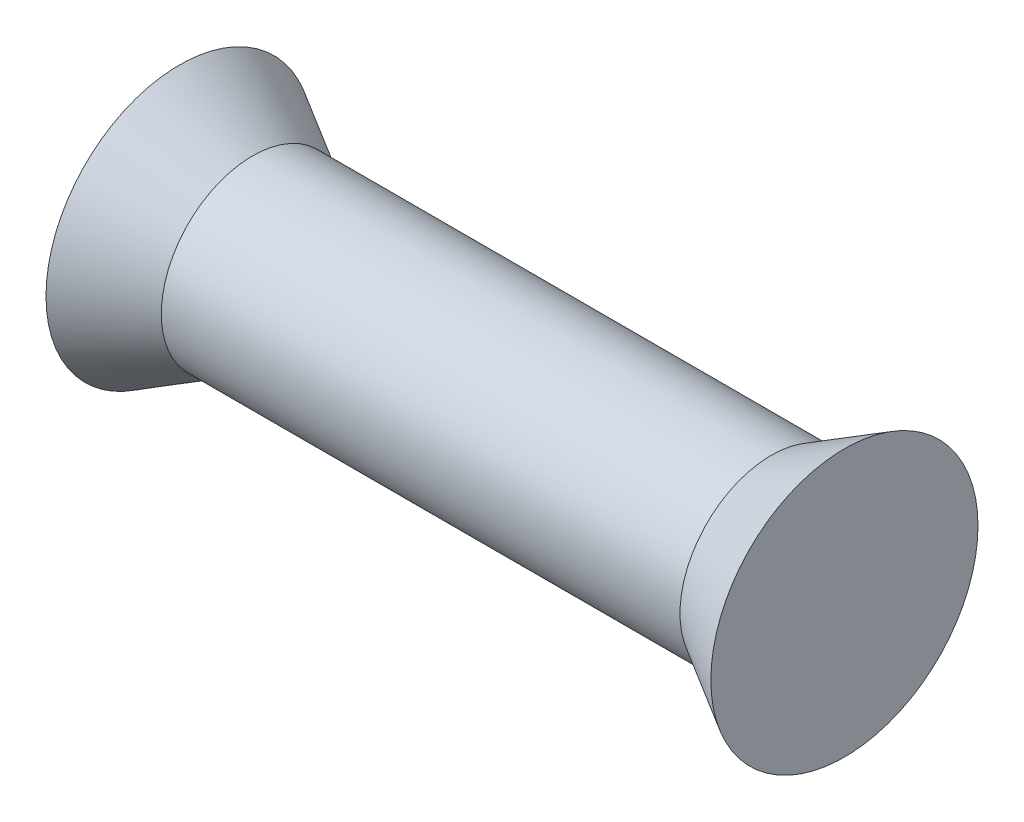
from build123d import *


with BuildPart() as part:
    # Sketch 1 → Revolve 1 (revolve)
    with BuildSketch(Plane.XY, mode=Mode.PRIVATE) as revolve_1_sk:
        Polygon((0, 0), (0, 2.877711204), (-1.5748, 1.9685), (-12.7508, 1.9685), (-14.3256, 2.877711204), (-14.3256, 0), align=None)
    revolve(revolve_1_sk.sketch.rotate(Axis((0, 0, 0), (-1, 0, 0)), 90), axis=Axis((0, 0, 0), (-1, 0, 0)))


solid = part.part
